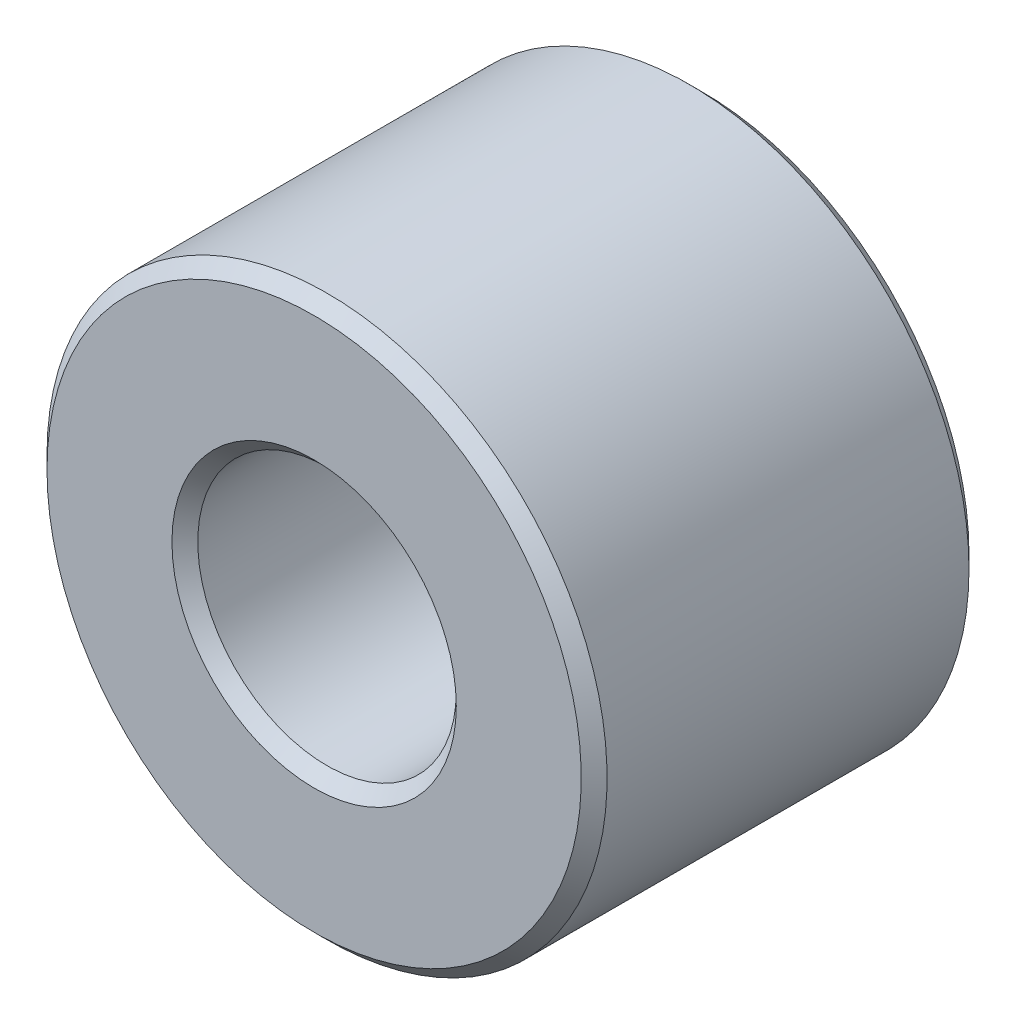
from build123d import *

# Parameters (mm, degrees)
SKETCH1_R           = 13
SKETCH1_R_2         = 6
BOSS_EXTRUDE1_DEPTH = 9
CHAMFER1_SIZE       = 0.6


with BuildPart() as part:
    # Sketch1 → Boss-Extrude1 (new, symmetric)
    with BuildSketch(Plane.XY):
        Circle(SKETCH1_R)
        Circle(SKETCH1_R_2, mode=Mode.SUBTRACT)
    extrude(amount=BOSS_EXTRUDE1_DEPTH, both=True)

    # Chamfer1
    chamfer1_edges = [part.edges().sort_by_distance(p)[0] for p in [
        (-13, 0, -9),
        (-13, 0, 9),
        (-6, 0, -9),
        (-6, 0, 9),
    ]]
    chamfer(chamfer1_edges, length=CHAMFER1_SIZE)


solid = part.part
